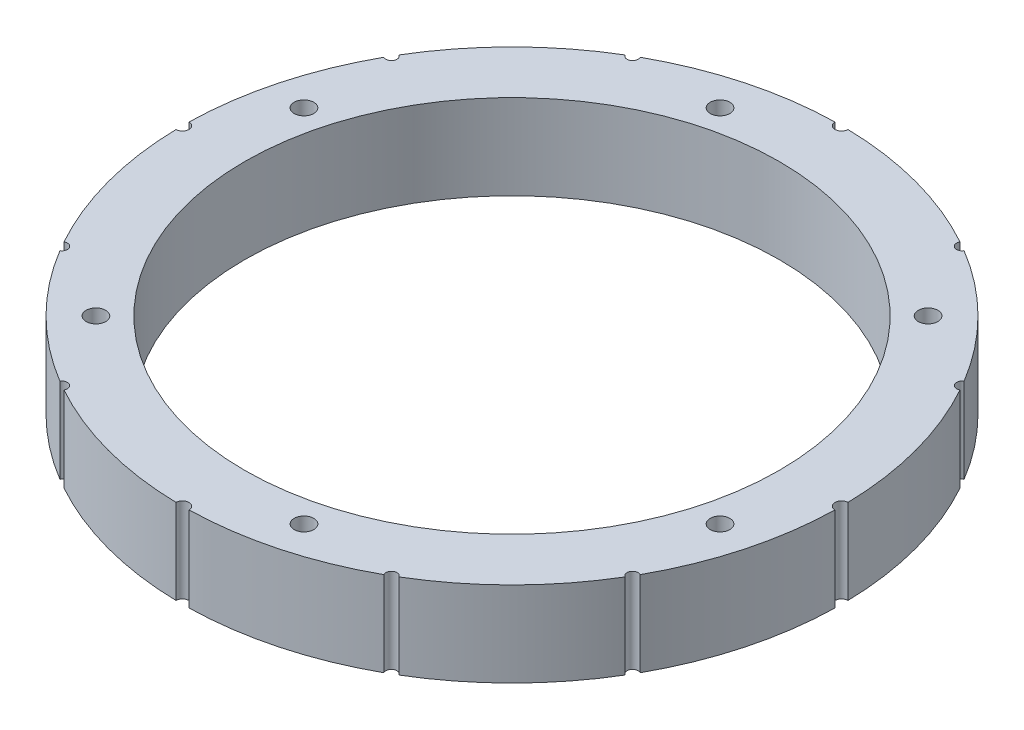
ISO-10303-21;
HEADER;
FILE_DESCRIPTION(('STEP AP214'),'2;1');
FILE_NAME('part.step','',(''),(''),'','','');
FILE_SCHEMA(('AUTOMOTIVE_DESIGN { 1 0 10303 214 1 1 1 1 }'));
ENDSEC;
DATA;
#1=APPLICATION_CONTEXT('core data for automotive mechanical design processes');
#2=APPLICATION_PROTOCOL_DEFINITION('international standard','automotive_design',2000,#1);
#3=PRODUCT_CONTEXT('',#1,'mechanical');
#4=PRODUCT('Part','Part','',(#3));
#5=PRODUCT_RELATED_PRODUCT_CATEGORY('part','',(#4));
#6=PRODUCT_DEFINITION_FORMATION('','',#4);
#7=PRODUCT_DEFINITION_CONTEXT('part definition',#1,'design');
#8=PRODUCT_DEFINITION('design','',#6,#7);
#9=PRODUCT_DEFINITION_SHAPE('','',#8);
#10=(LENGTH_UNIT() NAMED_UNIT(*) SI_UNIT(.MILLI.,.METRE.));
#11=(NAMED_UNIT(*) PLANE_ANGLE_UNIT() SI_UNIT($,.RADIAN.));
#12=(NAMED_UNIT(*) SI_UNIT($,.STERADIAN.) SOLID_ANGLE_UNIT());
#13=UNCERTAINTY_MEASURE_WITH_UNIT(LENGTH_MEASURE(1.E-05),#10,'distance_accuracy_value','');
#14=(GEOMETRIC_REPRESENTATION_CONTEXT(3) GLOBAL_UNCERTAINTY_ASSIGNED_CONTEXT((#13)) GLOBAL_UNIT_ASSIGNED_CONTEXT((#10,
#11,#12)) REPRESENTATION_CONTEXT('',''));
#15=CARTESIAN_POINT('',(0.,0.,0.));
#16=DIRECTION('',(0.,0.,1.));
#17=DIRECTION('',(1.,0.,0.));
#18=AXIS2_PLACEMENT_3D('',#15,#16,#17);
#19=CARTESIAN_POINT('',(0.,-13.,0.));
#20=DIRECTION('',(0.,1.,0.));
#21=DIRECTION('',(0.,0.,1.));
#22=AXIS2_PLACEMENT_3D('',#19,#20,#21);
#23=CYLINDRICAL_SURFACE('',#22,50.4);
#24=DIRECTION('',(0.,-1.,0.));
#25=VECTOR('',#24,1.);
#26=CARTESIAN_POINT('',(0.999950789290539,-6.5,50.3900793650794));
#27=LINE('',#26,#25);
#28=CARTESIAN_POINT('',(0.999950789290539,-13.,50.3900793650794));
#29=VERTEX_POINT('',#28);
#30=CARTESIAN_POINT('',(0.999950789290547,0.,50.3900793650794));
#31=VERTEX_POINT('',#30);
#32=EDGE_CURVE('E289',#29,#31,#27,.F.);
#33=ORIENTED_EDGE('',*,*,#32,.F.);
#34=CARTESIAN_POINT('',(0.,-13.,0.));
#35=DIRECTION('',(0.,1.,0.));
#36=DIRECTION('',(0.,0.,1.));
#37=AXIS2_PLACEMENT_3D('',#34,#35,#36);
#38=CIRCLE('',#37,50.4);
#39=CARTESIAN_POINT('',(24.4603207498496,-13.,44.0664578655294));
#40=VERTEX_POINT('',#39);
#41=EDGE_CURVE('E240',#29,#40,#38,.T.);
#42=ORIENTED_EDGE('',*,*,#41,.T.);
#43=DIRECTION('',(0.,-1.,0.));
#44=VECTOR('',#43,1.);
#45=CARTESIAN_POINT('',(24.4603207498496,-6.5,44.0664578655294));
#46=LINE('',#45,#44);
#47=CARTESIAN_POINT('',(24.4603207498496,0.,44.0664578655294));
#48=VERTEX_POINT('',#47);
#49=EDGE_CURVE('E318',#48,#40,#46,.T.);
#50=ORIENTED_EDGE('',*,*,#49,.F.);
#51=CARTESIAN_POINT('',(0.,0.,0.));
#52=DIRECTION('',(0.,1.,0.));
#53=DIRECTION('',(0.,0.,1.));
#54=AXIS2_PLACEMENT_3D('',#51,#52,#53);
#55=CIRCLE('',#54,50.4);
#56=EDGE_CURVE('E233',#31,#48,#55,.T.);
#57=ORIENTED_EDGE('',*,*,#56,.F.);
#58=EDGE_LOOP('',(#33,#42,#50,#57));
#59=FACE_BOUND('',#58,.T.);
#60=ADVANCED_FACE('F39',(#59),#23,.T.);
#61=DIRECTION('',(0.,-1.,0.));
#62=VECTOR('',#61,1.);
#63=CARTESIAN_POINT('',(-43.2164880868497,-6.5,25.9325115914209));
#64=LINE('',#63,#62);
#65=CARTESIAN_POINT('',(-43.2164880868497,-13.,25.9325115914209));
#66=VERTEX_POINT('',#65);
#67=CARTESIAN_POINT('',(-43.2164880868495,0.,25.9325115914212));
#68=VERTEX_POINT('',#67);
#69=EDGE_CURVE('E62',#66,#68,#64,.F.);
#70=ORIENTED_EDGE('',*,*,#69,.F.);
#71=CARTESIAN_POINT('',(-25.9325115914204,-13.,43.21648808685));
#72=VERTEX_POINT('',#71);
#73=EDGE_CURVE('E479',#66,#72,#38,.T.);
#74=ORIENTED_EDGE('',*,*,#73,.T.);
#75=DIRECTION('',(0.,-1.,0.));
#76=VECTOR('',#75,1.);
#77=CARTESIAN_POINT('',(-25.9325115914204,-6.5,43.21648808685));
#78=LINE('',#77,#76);
#79=CARTESIAN_POINT('',(-25.9325115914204,0.,43.21648808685));
#80=VERTEX_POINT('',#79);
#81=EDGE_CURVE('E314',#80,#72,#78,.T.);
#82=ORIENTED_EDGE('',*,*,#81,.F.);
#83=EDGE_CURVE('E276',#68,#80,#55,.T.);
#84=ORIENTED_EDGE('',*,*,#83,.F.);
#85=EDGE_LOOP('',(#70,#74,#82,#84));
#86=FACE_BOUND('',#85,.T.);
#87=ADVANCED_FACE('F441',(#86),#23,.T.);
#88=DIRECTION('',(0.,-1.,0.));
#89=VECTOR('',#88,1.);
#90=CARTESIAN_POINT('',(-44.0664578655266,-6.5,-24.4603207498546));
#91=LINE('',#90,#89);
#92=CARTESIAN_POINT('',(-44.0664578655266,-13.,-24.4603207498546));
#93=VERTEX_POINT('',#92);
#94=CARTESIAN_POINT('',(-44.0664578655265,0.,-24.4603207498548));
#95=VERTEX_POINT('',#94);
#96=EDGE_CURVE('E297',#93,#95,#91,.F.);
#97=ORIENTED_EDGE('',*,*,#96,.F.);
#98=CARTESIAN_POINT('',(-50.3900793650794,-13.,-0.999950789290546));
#99=VERTEX_POINT('',#98);
#100=EDGE_CURVE('E469',#93,#99,#38,.T.);
#101=ORIENTED_EDGE('',*,*,#100,.T.);
#102=DIRECTION('',(0.,-1.,0.));
#103=VECTOR('',#102,1.);
#104=CARTESIAN_POINT('',(-50.3900793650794,-6.5,-0.999950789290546));
#105=LINE('',#104,#103);
#106=CARTESIAN_POINT('',(-50.3900793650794,0.,-0.999950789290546));
#107=VERTEX_POINT('',#106);
#108=EDGE_CURVE('E311',#107,#99,#105,.T.);
#109=ORIENTED_EDGE('',*,*,#108,.F.);
#110=EDGE_CURVE('E269',#95,#107,#55,.T.);
#111=ORIENTED_EDGE('',*,*,#110,.F.);
#112=EDGE_LOOP('',(#97,#101,#109,#111));
#113=FACE_BOUND('',#112,.T.);
#114=ADVANCED_FACE('F446',(#113),#23,.T.);
#115=DIRECTION('',(0.,-1.,0.));
#116=VECTOR('',#115,1.);
#117=CARTESIAN_POINT('',(-43.216488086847,-6.5,-25.9325115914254));
#118=LINE('',#117,#116);
#119=CARTESIAN_POINT('',(-43.216488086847,0.,-25.9325115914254));
#120=VERTEX_POINT('',#119);
#121=CARTESIAN_POINT('',(-43.216488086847,-13.,-25.9325115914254));
#122=VERTEX_POINT('',#121);
#123=EDGE_CURVE('E299',#120,#122,#118,.T.);
#124=ORIENTED_EDGE('',*,*,#123,.F.);
#125=CARTESIAN_POINT('',(-25.9325115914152,0.,-43.2164880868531));
#126=VERTEX_POINT('',#125);
#127=EDGE_CURVE('E268',#126,#120,#55,.T.);
#128=ORIENTED_EDGE('',*,*,#127,.F.);
#129=DIRECTION('',(0.,-1.,0.));
#130=VECTOR('',#129,1.);
#131=CARTESIAN_POINT('',(-25.9325115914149,-6.5,-43.2164880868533));
#132=LINE('',#131,#130);
#133=CARTESIAN_POINT('',(-25.9325115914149,-13.,-43.2164880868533));
#134=VERTEX_POINT('',#133);
#135=EDGE_CURVE('E253',#134,#126,#132,.F.);
#136=ORIENTED_EDGE('',*,*,#135,.F.);
#137=EDGE_CURVE('E467',#134,#122,#38,.T.);
#138=ORIENTED_EDGE('',*,*,#137,.T.);
#139=EDGE_LOOP('',(#124,#128,#136,#138));
#140=FACE_BOUND('',#139,.T.);
#141=ADVANCED_FACE('F812',(#140),#23,.T.);
#142=DIRECTION('',(0.,-1.,0.));
#143=VECTOR('',#142,1.);
#144=CARTESIAN_POINT('',(50.3900793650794,-6.5,-0.999950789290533));
#145=LINE('',#144,#143);
#146=CARTESIAN_POINT('',(50.3900793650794,-13.,-0.999950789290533));
#147=VERTEX_POINT('',#146);
#148=CARTESIAN_POINT('',(50.3900793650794,0.,-0.999950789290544));
#149=VERTEX_POINT('',#148);
#150=EDGE_CURVE('E264',#147,#149,#145,.F.);
#151=ORIENTED_EDGE('',*,*,#150,.F.);
#152=CARTESIAN_POINT('',(44.0664578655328,-13.,-24.4603207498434));
#153=VERTEX_POINT('',#152);
#154=EDGE_CURVE('E501',#147,#153,#38,.T.);
#155=ORIENTED_EDGE('',*,*,#154,.T.);
#156=DIRECTION('',(0.,-1.,0.));
#157=VECTOR('',#156,1.);
#158=CARTESIAN_POINT('',(44.0664578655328,-6.5,-24.4603207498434));
#159=LINE('',#158,#157);
#160=CARTESIAN_POINT('',(44.0664578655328,0.,-24.4603207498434));
#161=VERTEX_POINT('',#160);
#162=EDGE_CURVE('E326',#161,#153,#159,.T.);
#163=ORIENTED_EDGE('',*,*,#162,.F.);
#164=EDGE_CURVE('E228',#149,#161,#55,.T.);
#165=ORIENTED_EDGE('',*,*,#164,.F.);
#166=EDGE_LOOP('',(#151,#155,#163,#165));
#167=FACE_BOUND('',#166,.T.);
#168=ADVANCED_FACE('F511',(#167),#23,.T.);
#169=DIRECTION('',(0.,-1.,0.));
#170=VECTOR('',#169,1.);
#171=CARTESIAN_POINT('',(-24.4603207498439,-6.5,-44.0664578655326));
#172=LINE('',#171,#170);
#173=CARTESIAN_POINT('',(-24.4603207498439,0.,-44.0664578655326));
#174=VERTEX_POINT('',#173);
#175=CARTESIAN_POINT('',(-24.4603207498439,-13.,-44.0664578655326));
#176=VERTEX_POINT('',#175);
#177=EDGE_CURVE('E250',#174,#176,#172,.T.);
#178=ORIENTED_EDGE('',*,*,#177,.F.);
#179=CARTESIAN_POINT('',(-0.999950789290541,0.,-50.3900793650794));
#180=VERTEX_POINT('',#179);
#181=EDGE_CURVE('E232',#180,#174,#55,.T.);
#182=ORIENTED_EDGE('',*,*,#181,.F.);
#183=DIRECTION('',(0.,-1.,0.));
#184=VECTOR('',#183,1.);
#185=CARTESIAN_POINT('',(-0.999950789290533,-6.5,-50.3900793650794));
#186=LINE('',#185,#184);
#187=CARTESIAN_POINT('',(-0.999950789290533,-13.,-50.3900793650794));
#188=VERTEX_POINT('',#187);
#189=EDGE_CURVE('E305',#188,#180,#186,.F.);
#190=ORIENTED_EDGE('',*,*,#189,.F.);
#191=EDGE_CURVE('E263',#188,#176,#38,.T.);
#192=ORIENTED_EDGE('',*,*,#191,.T.);
#193=EDGE_LOOP('',(#178,#182,#190,#192));
#194=FACE_BOUND('',#193,.T.);
#195=ADVANCED_FACE('F260',(#194),#23,.T.);
#196=DIRECTION('',(0.,-1.,0.));
#197=VECTOR('',#196,1.);
#198=CARTESIAN_POINT('',(-44.0664578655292,-6.5,24.46032074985));
#199=LINE('',#198,#197);
#200=CARTESIAN_POINT('',(-44.0664578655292,0.,24.46032074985));
#201=VERTEX_POINT('',#200);
#202=CARTESIAN_POINT('',(-44.0664578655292,-13.,24.46032074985));
#203=VERTEX_POINT('',#202);
#204=EDGE_CURVE('E295',#201,#203,#199,.T.);
#205=ORIENTED_EDGE('',*,*,#204,.F.);
#206=CARTESIAN_POINT('',(-50.3900793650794,0.,0.999950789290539));
#207=VERTEX_POINT('',#206);
#208=EDGE_CURVE('E272',#207,#201,#55,.T.);
#209=ORIENTED_EDGE('',*,*,#208,.F.);
#210=DIRECTION('',(0.,-1.,0.));
#211=VECTOR('',#210,1.);
#212=CARTESIAN_POINT('',(-50.3900793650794,-6.5,0.999950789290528));
#213=LINE('',#212,#211);
#214=CARTESIAN_POINT('',(-50.3900793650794,-13.,0.999950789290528));
#215=VERTEX_POINT('',#214);
#216=EDGE_CURVE('E309',#215,#207,#213,.F.);
#217=ORIENTED_EDGE('',*,*,#216,.F.);
#218=EDGE_CURVE('E473',#215,#203,#38,.T.);
#219=ORIENTED_EDGE('',*,*,#218,.T.);
#220=EDGE_LOOP('',(#205,#209,#217,#219));
#221=FACE_BOUND('',#220,.T.);
#222=ADVANCED_FACE('F793',(#221),#23,.T.);
#223=DIRECTION('',(0.,-1.,0.));
#224=VECTOR('',#223,1.);
#225=CARTESIAN_POINT('',(-0.999950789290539,-6.5,50.3900793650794));
#226=LINE('',#225,#224);
#227=CARTESIAN_POINT('',(-0.999950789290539,0.,50.3900793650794));
#228=VERTEX_POINT('',#227);
#229=CARTESIAN_POINT('',(-0.999950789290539,-13.,50.3900793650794));
#230=VERTEX_POINT('',#229);
#231=EDGE_CURVE('E292',#228,#230,#226,.T.);
#232=ORIENTED_EDGE('',*,*,#231,.F.);
#233=CARTESIAN_POINT('',(-24.4603207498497,0.,44.0664578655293));
#234=VERTEX_POINT('',#233);
#235=EDGE_CURVE('E239',#234,#228,#55,.T.);
#236=ORIENTED_EDGE('',*,*,#235,.F.);
#237=DIRECTION('',(0.,-1.,0.));
#238=VECTOR('',#237,1.);
#239=CARTESIAN_POINT('',(-24.4603207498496,-6.5,44.0664578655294));
#240=LINE('',#239,#238);
#241=CARTESIAN_POINT('',(-24.4603207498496,-13.,44.0664578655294));
#242=VERTEX_POINT('',#241);
#243=EDGE_CURVE('E54',#242,#234,#240,.F.);
#244=ORIENTED_EDGE('',*,*,#243,.F.);
#245=EDGE_CURVE('E237',#242,#230,#38,.T.);
#246=ORIENTED_EDGE('',*,*,#245,.T.);
#247=EDGE_LOOP('',(#232,#236,#244,#246));
#248=FACE_BOUND('',#247,.T.);
#249=ADVANCED_FACE('F786',(#248),#23,.T.);
#250=DIRECTION('',(0.,-1.,0.));
#251=VECTOR('',#250,1.);
#252=CARTESIAN_POINT('',(25.9325115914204,-6.5,43.21648808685));
#253=LINE('',#252,#251);
#254=CARTESIAN_POINT('',(25.9325115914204,-13.,43.21648808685));
#255=VERTEX_POINT('',#254);
#256=CARTESIAN_POINT('',(25.9325115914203,0.,43.2164880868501));
#257=VERTEX_POINT('',#256);
#258=EDGE_CURVE('E316',#255,#257,#253,.F.);
#259=ORIENTED_EDGE('',*,*,#258,.F.);
#260=CARTESIAN_POINT('',(43.216488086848,-13.,25.9325115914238));
#261=VERTEX_POINT('',#260);
#262=EDGE_CURVE('E492',#255,#261,#38,.T.);
#263=ORIENTED_EDGE('',*,*,#262,.T.);
#264=DIRECTION('',(0.,-1.,0.));
#265=VECTOR('',#264,1.);
#266=CARTESIAN_POINT('',(43.216488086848,-6.5,25.9325115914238));
#267=LINE('',#266,#265);
#268=CARTESIAN_POINT('',(43.216488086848,0.,25.9325115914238));
#269=VERTEX_POINT('',#268);
#270=EDGE_CURVE('E322',#269,#261,#267,.T.);
#271=ORIENTED_EDGE('',*,*,#270,.F.);
#272=EDGE_CURVE('E238',#257,#269,#55,.T.);
#273=ORIENTED_EDGE('',*,*,#272,.F.);
#274=EDGE_LOOP('',(#259,#263,#271,#273));
#275=FACE_BOUND('',#274,.T.);
#276=ADVANCED_FACE('F779',(#275),#23,.T.);
#277=DIRECTION('',(0.,-1.,0.));
#278=VECTOR('',#277,1.);
#279=CARTESIAN_POINT('',(50.3900793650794,-6.5,0.99995078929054));
#280=LINE('',#279,#278);
#281=CARTESIAN_POINT('',(50.3900793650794,0.,0.99995078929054));
#282=VERTEX_POINT('',#281);
#283=CARTESIAN_POINT('',(50.3900793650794,-13.,0.99995078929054));
#284=VERTEX_POINT('',#283);
#285=EDGE_CURVE('E303',#282,#284,#280,.T.);
#286=ORIENTED_EDGE('',*,*,#285,.F.);
#287=CARTESIAN_POINT('',(44.0664578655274,0.,24.4603207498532));
#288=VERTEX_POINT('',#287);
#289=EDGE_CURVE('E231',#288,#282,#55,.T.);
#290=ORIENTED_EDGE('',*,*,#289,.F.);
#291=DIRECTION('',(0.,-1.,0.));
#292=VECTOR('',#291,1.);
#293=CARTESIAN_POINT('',(44.0664578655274,-6.5,24.4603207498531));
#294=LINE('',#293,#292);
#295=CARTESIAN_POINT('',(44.0664578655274,-13.,24.4603207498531));
#296=VERTEX_POINT('',#295);
#297=EDGE_CURVE('E320',#296,#288,#294,.F.);
#298=ORIENTED_EDGE('',*,*,#297,.F.);
#299=EDGE_CURVE('E495',#296,#284,#38,.T.);
#300=ORIENTED_EDGE('',*,*,#299,.T.);
#301=EDGE_LOOP('',(#286,#290,#298,#300));
#302=FACE_BOUND('',#301,.T.);
#303=ADVANCED_FACE('F456',(#302),#23,.T.);
#304=DIRECTION('',(0.,-1.,0.));
#305=VECTOR('',#304,1.);
#306=CARTESIAN_POINT('',(43.2164880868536,-6.5,-25.9325115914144));
#307=LINE('',#306,#305);
#308=CARTESIAN_POINT('',(43.2164880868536,-13.,-25.9325115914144));
#309=VERTEX_POINT('',#308);
#310=CARTESIAN_POINT('',(43.2164880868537,0.,-25.9325115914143));
#311=VERTEX_POINT('',#310);
#312=EDGE_CURVE('E324',#309,#311,#307,.F.);
#313=ORIENTED_EDGE('',*,*,#312,.F.);
#314=CARTESIAN_POINT('',(25.9325115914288,-13.,-43.216488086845));
#315=VERTEX_POINT('',#314);
#316=EDGE_CURVE('E219',#309,#315,#38,.T.);
#317=ORIENTED_EDGE('',*,*,#316,.T.);
#318=DIRECTION('',(0.,-1.,0.));
#319=VECTOR('',#318,1.);
#320=CARTESIAN_POINT('',(25.9325115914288,-6.5,-43.216488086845));
#321=LINE('',#320,#319);
#322=CARTESIAN_POINT('',(25.9325115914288,0.,-43.216488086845));
#323=VERTEX_POINT('',#322);
#324=EDGE_CURVE('E201',#323,#315,#321,.T.);
#325=ORIENTED_EDGE('',*,*,#324,.F.);
#326=EDGE_CURVE('E217',#311,#323,#55,.T.);
#327=ORIENTED_EDGE('',*,*,#326,.F.);
#328=EDGE_LOOP('',(#313,#317,#325,#327));
#329=FACE_BOUND('',#328,.T.);
#330=ADVANCED_FACE('F216',(#329),#23,.T.);
#331=DIRECTION('',(0.,-1.,0.));
#332=VECTOR('',#331,1.);
#333=CARTESIAN_POINT('',(0.999950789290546,-6.5,-50.3900793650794));
#334=LINE('',#333,#332);
#335=CARTESIAN_POINT('',(0.999950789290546,0.,-50.3900793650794));
#336=VERTEX_POINT('',#335);
#337=CARTESIAN_POINT('',(0.999950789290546,-13.,-50.3900793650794));
#338=VERTEX_POINT('',#337);
#339=EDGE_CURVE('E307',#336,#338,#334,.T.);
#340=ORIENTED_EDGE('',*,*,#339,.F.);
#341=CARTESIAN_POINT('',(24.4603207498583,0.,-44.0664578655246));
#342=VERTEX_POINT('',#341);
#343=EDGE_CURVE('E229',#342,#336,#55,.T.);
#344=ORIENTED_EDGE('',*,*,#343,.F.);
#345=DIRECTION('',(0.,-1.,0.));
#346=VECTOR('',#345,1.);
#347=CARTESIAN_POINT('',(24.4603207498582,-6.5,-44.0664578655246));
#348=LINE('',#347,#346);
#349=CARTESIAN_POINT('',(24.4603207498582,-13.,-44.0664578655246));
#350=VERTEX_POINT('',#349);
#351=EDGE_CURVE('E204',#350,#342,#348,.F.);
#352=ORIENTED_EDGE('',*,*,#351,.F.);
#353=EDGE_CURVE('E460',#350,#338,#38,.T.);
#354=ORIENTED_EDGE('',*,*,#353,.T.);
#355=EDGE_LOOP('',(#340,#344,#352,#354));
#356=FACE_BOUND('',#355,.T.);
#357=ADVANCED_FACE('F41',(#356),#23,.T.);
#358=CARTESIAN_POINT('',(0.,-13.,0.));
#359=DIRECTION('',(0.,1.,0.));
#360=DIRECTION('',(0.,0.,1.));
#361=AXIS2_PLACEMENT_3D('',#358,#359,#360);
#362=PLANE('',#361);
#363=CARTESIAN_POINT('',(0.,-13.,0.));
#364=DIRECTION('',(0.,1.,0.));
#365=DIRECTION('',(0.,0.,1.));
#366=AXIS2_PLACEMENT_3D('',#363,#364,#365);
#367=CIRCLE('',#366,40.9);
#368=CARTESIAN_POINT('',(0.,-13.,40.9));
#369=VERTEX_POINT('',#368);
#370=EDGE_CURVE('E281',#369,#369,#367,.T.);
#371=ORIENTED_EDGE('',*,*,#370,.T.);
#372=EDGE_LOOP('',(#371));
#373=FACE_BOUND('',#372,.T.);
#374=ORIENTED_EDGE('',*,*,#41,.F.);
#375=CARTESIAN_POINT('',(0.,-13.,50.4));
#376=DIRECTION('',(0.,-1.,0.));
#377=DIRECTION('',(0.,0.,-1.));
#378=AXIS2_PLACEMENT_3D('',#375,#376,#377);
#379=CIRCLE('',#378,1.);
#380=EDGE_CURVE('E220',#230,#29,#379,.T.);
#381=ORIENTED_EDGE('',*,*,#380,.F.);
#382=ORIENTED_EDGE('',*,*,#245,.F.);
#383=CARTESIAN_POINT('',(-25.2000000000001,-13.,43.6476803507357));
#384=DIRECTION('',(0.,-1.,0.));
#385=DIRECTION('',(0.,0.,-1.));
#386=AXIS2_PLACEMENT_3D('',#383,#384,#385);
#387=CIRCLE('',#386,0.850000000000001);
#388=EDGE_CURVE('E329',#72,#242,#387,.T.);
#389=ORIENTED_EDGE('',*,*,#388,.F.);
#390=ORIENTED_EDGE('',*,*,#73,.F.);
#391=CARTESIAN_POINT('',(-43.6476803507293,-13.,25.199999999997));
#392=DIRECTION('',(0.,-1.,0.));
#393=DIRECTION('',(0.,0.,1.));
#394=AXIS2_PLACEMENT_3D('',#391,#392,#393);
#395=CIRCLE('',#394,0.85);
#396=EDGE_CURVE('E353',#203,#66,#395,.T.);
#397=ORIENTED_EDGE('',*,*,#396,.F.);
#398=ORIENTED_EDGE('',*,*,#218,.F.);
#399=CARTESIAN_POINT('',(-50.4,-13.,0.));
#400=DIRECTION('',(0.,-1.,0.));
#401=DIRECTION('',(0.,0.,-1.));
#402=AXIS2_PLACEMENT_3D('',#399,#400,#401);
#403=CIRCLE('',#402,0.999999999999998);
#404=EDGE_CURVE('E331',#99,#215,#403,.T.);
#405=ORIENTED_EDGE('',*,*,#404,.F.);
#406=ORIENTED_EDGE('',*,*,#100,.F.);
#407=CARTESIAN_POINT('',(-43.6476803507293,-13.,-25.2000000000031));
#408=DIRECTION('',(0.,-1.,0.));
#409=DIRECTION('',(0.,0.,-1.));
#410=AXIS2_PLACEMENT_3D('',#407,#408,#409);
#411=CIRCLE('',#410,0.850000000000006);
#412=EDGE_CURVE('E358',#122,#93,#411,.T.);
#413=ORIENTED_EDGE('',*,*,#412,.F.);
#414=ORIENTED_EDGE('',*,*,#137,.F.);
#415=CARTESIAN_POINT('',(-25.1999999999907,-13.,-43.6476803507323));
#416=DIRECTION('',(0.,-1.,0.));
#417=DIRECTION('',(0.,0.,1.));
#418=AXIS2_PLACEMENT_3D('',#415,#416,#417);
#419=CIRCLE('',#418,0.849999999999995);
#420=EDGE_CURVE('E344',#176,#134,#419,.T.);
#421=ORIENTED_EDGE('',*,*,#420,.F.);
#422=ORIENTED_EDGE('',*,*,#191,.F.);
#423=CARTESIAN_POINT('',(0.,-13.,-50.4));
#424=DIRECTION('',(0.,-1.,0.));
#425=DIRECTION('',(0.,0.,-1.));
#426=AXIS2_PLACEMENT_3D('',#423,#424,#425);
#427=CIRCLE('',#426,1.);
#428=EDGE_CURVE('E336',#338,#188,#427,.T.);
#429=ORIENTED_EDGE('',*,*,#428,.F.);
#430=ORIENTED_EDGE('',*,*,#353,.F.);
#431=CARTESIAN_POINT('',(25.2000000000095,-13.,-43.6476803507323));
#432=DIRECTION('',(0.,-1.,0.));
#433=DIRECTION('',(0.,0.,-1.));
#434=AXIS2_PLACEMENT_3D('',#431,#432,#433);
#435=CIRCLE('',#434,0.850000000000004);
#436=EDGE_CURVE('E210',#315,#350,#435,.T.);
#437=ORIENTED_EDGE('',*,*,#436,.F.);
#438=ORIENTED_EDGE('',*,*,#316,.F.);
#439=CARTESIAN_POINT('',(43.6476803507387,-13.,-25.1999999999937));
#440=DIRECTION('',(0.,-1.,0.));
#441=DIRECTION('',(0.,0.,1.));
#442=AXIS2_PLACEMENT_3D('',#439,#440,#441);
#443=CIRCLE('',#442,0.850000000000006);
#444=EDGE_CURVE('E209',#153,#309,#443,.T.);
#445=ORIENTED_EDGE('',*,*,#444,.F.);
#446=ORIENTED_EDGE('',*,*,#154,.F.);
#447=CARTESIAN_POINT('',(50.4,-13.,0.));
#448=DIRECTION('',(0.,-1.,0.));
#449=DIRECTION('',(0.,0.,-1.));
#450=AXIS2_PLACEMENT_3D('',#447,#448,#449);
#451=CIRCLE('',#450,0.999999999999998);
#452=EDGE_CURVE('E339',#284,#147,#451,.T.);
#453=ORIENTED_EDGE('',*,*,#452,.F.);
#454=ORIENTED_EDGE('',*,*,#299,.F.);
#455=CARTESIAN_POINT('',(43.6476803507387,-13.,25.2000000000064));
#456=DIRECTION('',(0.,-1.,0.));
#457=DIRECTION('',(0.,0.,-1.));
#458=AXIS2_PLACEMENT_3D('',#455,#456,#457);
#459=CIRCLE('',#458,0.850000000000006);
#460=EDGE_CURVE('E347',#261,#296,#459,.T.);
#461=ORIENTED_EDGE('',*,*,#460,.F.);
#462=ORIENTED_EDGE('',*,*,#262,.F.);
#463=CARTESIAN_POINT('',(25.2000000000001,-13.,43.6476803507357));
#464=DIRECTION('',(0.,-1.,0.));
#465=DIRECTION('',(0.,0.,1.));
#466=AXIS2_PLACEMENT_3D('',#463,#464,#465);
#467=CIRCLE('',#466,0.850000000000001);
#468=EDGE_CURVE('E349',#40,#255,#467,.T.);
#469=ORIENTED_EDGE('',*,*,#468,.F.);
#470=EDGE_LOOP('',(#374,#381,#382,#389,#390,#397,#398,#405,#406,#413,#414,#421,#422,#429,#430,
#437,#438,#445,#446,#453,#454,#461,#462,#469));
#471=FACE_BOUND('',#470,.T.);
#472=ADVANCED_FACE('F412',(#373,#471),#362,.F.);
#473=CARTESIAN_POINT('',(0.,0.,0.));
#474=DIRECTION('',(0.,1.,0.));
#475=DIRECTION('',(0.,0.,1.));
#476=AXIS2_PLACEMENT_3D('',#473,#474,#475);
#477=PLANE('',#476);
#478=CARTESIAN_POINT('',(31.8198051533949,0.,-31.8198051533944));
#479=DIRECTION('',(0.,1.,0.));
#480=DIRECTION('',(-0.86602540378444,0.,0.499999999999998));
#481=AXIS2_PLACEMENT_3D('',#478,#479,#480);
#482=CIRCLE('',#481,1.5);
#483=CARTESIAN_POINT('',(30.5207670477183,0.,-31.0698051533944));
#484=VERTEX_POINT('',#483);
#485=EDGE_CURVE('E394',#484,#484,#482,.T.);
#486=ORIENTED_EDGE('',*,*,#485,.F.);
#487=EDGE_LOOP('',(#486));
#488=FACE_BOUND('',#487,.T.);
#489=CARTESIAN_POINT('',(43.466662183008,0.,11.6468570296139));
#490=DIRECTION('',(0.,1.,0.));
#491=DIRECTION('',(-0.866025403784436,0.,-0.500000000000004));
#492=AXIS2_PLACEMENT_3D('',#489,#490,#491);
#493=CIRCLE('',#492,1.5);
#494=CARTESIAN_POINT('',(42.1676240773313,0.,10.8968570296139));
#495=VERTEX_POINT('',#494);
#496=EDGE_CURVE('E388',#495,#495,#493,.T.);
#497=ORIENTED_EDGE('',*,*,#496,.F.);
#498=EDGE_LOOP('',(#497));
#499=FACE_BOUND('',#498,.T.);
#500=CARTESIAN_POINT('',(11.6468570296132,0.,43.4666621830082));
#501=DIRECTION('',(0.,1.,0.));
#502=DIRECTION('',(0.,0.,-1.));
#503=AXIS2_PLACEMENT_3D('',#500,#501,#502);
#504=CIRCLE('',#503,1.5);
#505=CARTESIAN_POINT('',(11.6468570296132,0.,41.9666621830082));
#506=VERTEX_POINT('',#505);
#507=EDGE_CURVE('E382',#506,#506,#504,.T.);
#508=ORIENTED_EDGE('',*,*,#507,.F.);
#509=EDGE_LOOP('',(#508));
#510=FACE_BOUND('',#509,.T.);
#511=CARTESIAN_POINT('',(-31.8198051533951,0.,31.8198051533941));
#512=DIRECTION('',(0.,1.,0.));
#513=DIRECTION('',(0.866025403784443,0.,-0.499999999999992));
#514=AXIS2_PLACEMENT_3D('',#511,#512,#513);
#515=CIRCLE('',#514,1.5);
#516=CARTESIAN_POINT('',(-30.5207670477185,0.,31.0698051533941));
#517=VERTEX_POINT('',#516);
#518=EDGE_CURVE('E376',#517,#517,#515,.T.);
#519=ORIENTED_EDGE('',*,*,#518,.F.);
#520=EDGE_LOOP('',(#519));
#521=FACE_BOUND('',#520,.T.);
#522=CARTESIAN_POINT('',(-43.4666621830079,0.,-11.6468570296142));
#523=DIRECTION('',(0.,1.,0.));
#524=DIRECTION('',(0.866025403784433,0.,0.50000000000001));
#525=AXIS2_PLACEMENT_3D('',#522,#523,#524);
#526=CIRCLE('',#525,1.5);
#527=CARTESIAN_POINT('',(-42.1676240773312,0.,-10.8968570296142));
#528=VERTEX_POINT('',#527);
#529=EDGE_CURVE('E370',#528,#528,#526,.T.);
#530=ORIENTED_EDGE('',*,*,#529,.F.);
#531=EDGE_LOOP('',(#530));
#532=FACE_BOUND('',#531,.T.);
#533=CARTESIAN_POINT('',(-11.6468570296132,0.,-43.4666621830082));
#534=DIRECTION('',(0.,1.,0.));
#535=DIRECTION('',(0.,0.,1.));
#536=AXIS2_PLACEMENT_3D('',#533,#534,#535);
#537=CIRCLE('',#536,1.5);
#538=CARTESIAN_POINT('',(-11.6468570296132,0.,-41.9666621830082));
#539=VERTEX_POINT('',#538);
#540=EDGE_CURVE('E364',#539,#539,#537,.T.);
#541=ORIENTED_EDGE('',*,*,#540,.F.);
#542=EDGE_LOOP('',(#541));
#543=FACE_BOUND('',#542,.T.);
#544=CARTESIAN_POINT('',(0.,0.,50.4));
#545=DIRECTION('',(0.,1.,0.));
#546=DIRECTION('',(0.,0.,1.));
#547=AXIS2_PLACEMENT_3D('',#544,#545,#546);
#548=CIRCLE('',#547,1.);
#549=EDGE_CURVE('E11',#31,#228,#548,.T.);
#550=ORIENTED_EDGE('',*,*,#549,.F.);
#551=ORIENTED_EDGE('',*,*,#56,.T.);
#552=CARTESIAN_POINT('',(25.2000000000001,0.,43.6476803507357));
#553=DIRECTION('',(0.,-1.,0.));
#554=DIRECTION('',(0.,0.,1.));
#555=AXIS2_PLACEMENT_3D('',#552,#553,#554);
#556=CIRCLE('',#555,0.850000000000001);
#557=EDGE_CURVE('E332',#48,#257,#556,.T.);
#558=ORIENTED_EDGE('',*,*,#557,.T.);
#559=ORIENTED_EDGE('',*,*,#272,.T.);
#560=CARTESIAN_POINT('',(43.6476803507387,0.,25.2000000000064));
#561=DIRECTION('',(0.,1.,0.));
#562=DIRECTION('',(0.,0.,1.));
#563=AXIS2_PLACEMENT_3D('',#560,#561,#562);
#564=CIRCLE('',#563,0.850000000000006);
#565=EDGE_CURVE('E243',#288,#269,#564,.T.);
#566=ORIENTED_EDGE('',*,*,#565,.F.);
#567=ORIENTED_EDGE('',*,*,#289,.T.);
#568=CARTESIAN_POINT('',(50.4,0.,0.));
#569=DIRECTION('',(0.,-1.,0.));
#570=DIRECTION('',(0.,0.,-1.));
#571=AXIS2_PLACEMENT_3D('',#568,#569,#570);
#572=CIRCLE('',#571,0.999999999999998);
#573=EDGE_CURVE('E341',#282,#149,#572,.T.);
#574=ORIENTED_EDGE('',*,*,#573,.T.);
#575=ORIENTED_EDGE('',*,*,#164,.T.);
#576=CARTESIAN_POINT('',(43.6476803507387,0.,-25.1999999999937));
#577=DIRECTION('',(0.,1.,0.));
#578=DIRECTION('',(0.,0.,1.));
#579=AXIS2_PLACEMENT_3D('',#576,#577,#578);
#580=CIRCLE('',#579,0.850000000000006);
#581=EDGE_CURVE('E227',#311,#161,#580,.T.);
#582=ORIENTED_EDGE('',*,*,#581,.F.);
#583=ORIENTED_EDGE('',*,*,#326,.T.);
#584=CARTESIAN_POINT('',(25.2000000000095,0.,-43.6476803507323));
#585=DIRECTION('',(0.,-1.,0.));
#586=DIRECTION('',(0.,0.,-1.));
#587=AXIS2_PLACEMENT_3D('',#584,#585,#586);
#588=CIRCLE('',#587,0.850000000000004);
#589=EDGE_CURVE('E198',#323,#342,#588,.T.);
#590=ORIENTED_EDGE('',*,*,#589,.T.);
#591=ORIENTED_EDGE('',*,*,#343,.T.);
#592=CARTESIAN_POINT('',(0.,0.,-50.4));
#593=DIRECTION('',(0.,-1.,0.));
#594=DIRECTION('',(0.,0.,-1.));
#595=AXIS2_PLACEMENT_3D('',#592,#593,#594);
#596=CIRCLE('',#595,1.);
#597=EDGE_CURVE('E267',#336,#180,#596,.T.);
#598=ORIENTED_EDGE('',*,*,#597,.T.);
#599=ORIENTED_EDGE('',*,*,#181,.T.);
#600=CARTESIAN_POINT('',(-25.1999999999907,0.,-43.6476803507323));
#601=DIRECTION('',(0.,1.,0.));
#602=DIRECTION('',(0.,0.,1.));
#603=AXIS2_PLACEMENT_3D('',#600,#601,#602);
#604=CIRCLE('',#603,0.849999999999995);
#605=EDGE_CURVE('E47',#126,#174,#604,.T.);
#606=ORIENTED_EDGE('',*,*,#605,.F.);
#607=ORIENTED_EDGE('',*,*,#127,.T.);
#608=CARTESIAN_POINT('',(-43.6476803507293,0.,-25.2000000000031));
#609=DIRECTION('',(0.,-1.,0.));
#610=DIRECTION('',(0.,0.,-1.));
#611=AXIS2_PLACEMENT_3D('',#608,#609,#610);
#612=CIRCLE('',#611,0.850000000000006);
#613=EDGE_CURVE('E360',#120,#95,#612,.T.);
#614=ORIENTED_EDGE('',*,*,#613,.T.);
#615=ORIENTED_EDGE('',*,*,#110,.T.);
#616=CARTESIAN_POINT('',(-50.4,0.,0.));
#617=DIRECTION('',(0.,-1.,0.));
#618=DIRECTION('',(0.,0.,-1.));
#619=AXIS2_PLACEMENT_3D('',#616,#617,#618);
#620=CIRCLE('',#619,0.999999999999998);
#621=EDGE_CURVE('E334',#107,#207,#620,.T.);
#622=ORIENTED_EDGE('',*,*,#621,.T.);
#623=ORIENTED_EDGE('',*,*,#208,.T.);
#624=CARTESIAN_POINT('',(-43.6476803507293,0.,25.199999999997));
#625=DIRECTION('',(0.,-1.,0.));
#626=DIRECTION('',(0.,0.,1.));
#627=AXIS2_PLACEMENT_3D('',#624,#625,#626);
#628=CIRCLE('',#627,0.85);
#629=EDGE_CURVE('E355',#201,#68,#628,.T.);
#630=ORIENTED_EDGE('',*,*,#629,.T.);
#631=ORIENTED_EDGE('',*,*,#83,.T.);
#632=CARTESIAN_POINT('',(-25.2000000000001,0.,43.6476803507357));
#633=DIRECTION('',(0.,1.,0.));
#634=DIRECTION('',(0.,0.,1.));
#635=AXIS2_PLACEMENT_3D('',#632,#633,#634);
#636=CIRCLE('',#635,0.850000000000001);
#637=EDGE_CURVE('E245',#234,#80,#636,.T.);
#638=ORIENTED_EDGE('',*,*,#637,.F.);
#639=ORIENTED_EDGE('',*,*,#235,.T.);
#640=EDGE_LOOP('',(#550,#551,#558,#559,#566,#567,#574,#575,#582,#583,#590,#591,#598,#599,#606,
#607,#614,#615,#622,#623,#630,#631,#638,#639));
#641=FACE_BOUND('',#640,.T.);
#642=CARTESIAN_POINT('',(0.,0.,0.));
#643=DIRECTION('',(0.,1.,0.));
#644=DIRECTION('',(0.,0.,1.));
#645=AXIS2_PLACEMENT_3D('',#642,#643,#644);
#646=CIRCLE('',#645,40.9);
#647=CARTESIAN_POINT('',(0.,0.,40.9));
#648=VERTEX_POINT('',#647);
#649=EDGE_CURVE('E284',#648,#648,#646,.T.);
#650=ORIENTED_EDGE('',*,*,#649,.F.);
#651=EDGE_LOOP('',(#650));
#652=FACE_BOUND('',#651,.T.);
#653=ADVANCED_FACE('F224',(#488,#499,#510,#521,#532,#543,#641,#652),#477,.T.);
#654=CARTESIAN_POINT('',(0.,-13.,0.));
#655=DIRECTION('',(0.,1.,0.));
#656=DIRECTION('',(0.,0.,1.));
#657=AXIS2_PLACEMENT_3D('',#654,#655,#656);
#658=CYLINDRICAL_SURFACE('',#657,40.9);
#659=CARTESIAN_POINT('',(0.,-13.,40.9));
#660=CARTESIAN_POINT('',(0.,-12.8645833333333,40.9));
#661=CARTESIAN_POINT('',(0.,-12.7291666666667,40.9));
#662=CARTESIAN_POINT('',(0.,-12.4583333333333,40.9));
#663=CARTESIAN_POINT('',(0.,-12.3229166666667,40.9));
#664=CARTESIAN_POINT('',(0.,-12.0520833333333,40.9));
#665=CARTESIAN_POINT('',(0.,-11.9166666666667,40.9));
#666=CARTESIAN_POINT('',(0.,-11.6458333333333,40.9));
#667=CARTESIAN_POINT('',(0.,-11.5104166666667,40.9));
#668=CARTESIAN_POINT('',(0.,-11.2395833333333,40.9));
#669=CARTESIAN_POINT('',(0.,-11.1041666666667,40.9));
#670=CARTESIAN_POINT('',(0.,-10.8333333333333,40.9));
#671=CARTESIAN_POINT('',(0.,-10.6979166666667,40.9));
#672=CARTESIAN_POINT('',(0.,-10.4270833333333,40.9));
#673=CARTESIAN_POINT('',(0.,-10.2916666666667,40.9));
#674=CARTESIAN_POINT('',(0.,-10.0208333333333,40.9));
#675=CARTESIAN_POINT('',(0.,-9.88541666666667,40.9));
#676=CARTESIAN_POINT('',(0.,-9.61458333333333,40.9));
#677=CARTESIAN_POINT('',(0.,-9.47916666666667,40.9));
#678=CARTESIAN_POINT('',(0.,-9.20833333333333,40.9));
#679=CARTESIAN_POINT('',(0.,-9.07291666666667,40.9));
#680=CARTESIAN_POINT('',(0.,-8.80208333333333,40.9));
#681=CARTESIAN_POINT('',(0.,-8.66666666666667,40.9));
#682=CARTESIAN_POINT('',(0.,-8.39583333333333,40.9));
#683=CARTESIAN_POINT('',(0.,-8.26041666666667,40.9));
#684=CARTESIAN_POINT('',(0.,-7.98958333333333,40.9));
#685=CARTESIAN_POINT('',(0.,-7.85416666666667,40.9));
#686=CARTESIAN_POINT('',(0.,-7.58333333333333,40.9));
#687=CARTESIAN_POINT('',(0.,-7.44791666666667,40.9));
#688=CARTESIAN_POINT('',(0.,-7.17708333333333,40.9));
#689=CARTESIAN_POINT('',(0.,-7.04166666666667,40.9));
#690=CARTESIAN_POINT('',(0.,-6.77083333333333,40.9));
#691=CARTESIAN_POINT('',(0.,-6.63541666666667,40.9));
#692=CARTESIAN_POINT('',(0.,-6.36458333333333,40.9));
#693=CARTESIAN_POINT('',(0.,-6.22916666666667,40.9));
#694=CARTESIAN_POINT('',(0.,-5.95833333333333,40.9));
#695=CARTESIAN_POINT('',(0.,-5.82291666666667,40.9));
#696=CARTESIAN_POINT('',(0.,-5.55208333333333,40.9));
#697=CARTESIAN_POINT('',(0.,-5.41666666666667,40.9));
#698=CARTESIAN_POINT('',(0.,-5.14583333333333,40.9));
#699=CARTESIAN_POINT('',(0.,-5.01041666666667,40.9));
#700=CARTESIAN_POINT('',(0.,-4.73958333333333,40.9));
#701=CARTESIAN_POINT('',(0.,-4.60416666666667,40.9));
#702=CARTESIAN_POINT('',(0.,-4.33333333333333,40.9));
#703=CARTESIAN_POINT('',(0.,-4.19791666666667,40.9));
#704=CARTESIAN_POINT('',(0.,-3.92708333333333,40.9));
#705=CARTESIAN_POINT('',(0.,-3.79166666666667,40.9));
#706=CARTESIAN_POINT('',(0.,-3.52083333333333,40.9));
#707=CARTESIAN_POINT('',(0.,-3.38541666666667,40.9));
#708=CARTESIAN_POINT('',(0.,-3.11458333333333,40.9));
#709=CARTESIAN_POINT('',(0.,-2.97916666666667,40.9));
#710=CARTESIAN_POINT('',(0.,-2.70833333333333,40.9));
#711=CARTESIAN_POINT('',(0.,-2.57291666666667,40.9));
#712=CARTESIAN_POINT('',(0.,-2.30208333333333,40.9));
#713=CARTESIAN_POINT('',(0.,-2.16666666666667,40.9));
#714=CARTESIAN_POINT('',(0.,-1.89583333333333,40.9));
#715=CARTESIAN_POINT('',(0.,-1.76041666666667,40.9));
#716=CARTESIAN_POINT('',(0.,-1.48958333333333,40.9));
#717=CARTESIAN_POINT('',(0.,-1.35416666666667,40.9));
#718=CARTESIAN_POINT('',(0.,-1.08333333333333,40.9));
#719=CARTESIAN_POINT('',(0.,-0.947916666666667,40.9));
#720=CARTESIAN_POINT('',(0.,-0.677083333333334,40.9));
#721=CARTESIAN_POINT('',(0.,-0.541666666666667,40.9));
#722=CARTESIAN_POINT('',(0.,-0.270833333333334,40.9));
#723=CARTESIAN_POINT('',(0.,-0.135416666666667,40.9));
#724=CARTESIAN_POINT('',(0.,0.,40.9));
#725=B_SPLINE_CURVE_WITH_KNOTS('',3,(#659,#660,#661,#662,#663,#664,#665,#666,#667,#668,#669,
#670,#671,#672,#673,#674,#675,#676,#677,#678,#679,#680,#681,#682,#683,#684,#685,#686,#687,#688,
#689,#690,#691,#692,#693,#694,#695,#696,#697,#698,#699,#700,#701,#702,#703,#704,#705,#706,#707,
#708,#709,#710,#711,#712,#713,#714,#715,#716,#717,#718,#719,#720,#721,#722,#723,#724),
.UNSPECIFIED.,.F.,.F.,(4,2,2,2,2,2,2,2,2,2,2,2,2,2,2,2,2,2,2,2,2,2,2,2,2,2,2,2,2,2,2,2,4),(0.,
0.40625,0.812500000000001,1.21875,1.625,2.03125,2.4375,2.84375,3.25,3.65625,4.0625,4.46875,
4.875,5.28125,5.6875,6.09375,6.5,6.90625,7.3125,7.71875,8.125,8.53125,8.9375,9.34375,9.75,
10.15625,10.5625,10.96875,11.375,11.78125,12.1875,12.59375,13.),.UNSPECIFIED.);
#726=EDGE_CURVE('BSEAM411',#369,#648,#725,.T.);
#727=ORIENTED_EDGE('',*,*,#370,.F.);
#728=ORIENTED_EDGE('',*,*,#649,.T.);
#729=ORIENTED_EDGE('',*,*,#726,.T.);
#730=ORIENTED_EDGE('',*,*,#726,.F.);
#731=EDGE_LOOP('',(#727,#729,#728,#730));
#732=FACE_BOUND('',#731,.T.);
#733=ADVANCED_FACE('F411',(#732),#658,.F.);
#734=CARTESIAN_POINT('',(25.2000000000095,0.,-43.6476803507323));
#735=DIRECTION('',(0.,-1.,0.));
#736=DIRECTION('',(0.,0.,-1.));
#737=AXIS2_PLACEMENT_3D('',#734,#735,#736);
#738=CYLINDRICAL_SURFACE('',#737,0.850000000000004);
#739=ORIENTED_EDGE('',*,*,#351,.T.);
#740=ORIENTED_EDGE('',*,*,#589,.F.);
#741=ORIENTED_EDGE('',*,*,#324,.T.);
#742=ORIENTED_EDGE('',*,*,#436,.T.);
#743=EDGE_LOOP('',(#739,#740,#741,#742));
#744=FACE_BOUND('',#743,.T.);
#745=ADVANCED_FACE('F200',(#744),#738,.F.);
#746=CARTESIAN_POINT('',(43.6476803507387,0.,-25.1999999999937));
#747=DIRECTION('',(0.,-1.,0.));
#748=DIRECTION('',(0.,0.,-1.));
#749=AXIS2_PLACEMENT_3D('',#746,#747,#748);
#750=CYLINDRICAL_SURFACE('',#749,0.850000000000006);
#751=ORIENTED_EDGE('',*,*,#312,.T.);
#752=ORIENTED_EDGE('',*,*,#581,.T.);
#753=ORIENTED_EDGE('',*,*,#162,.T.);
#754=ORIENTED_EDGE('',*,*,#444,.T.);
#755=EDGE_LOOP('',(#751,#752,#753,#754));
#756=FACE_BOUND('',#755,.T.);
#757=ADVANCED_FACE('F516',(#756),#750,.F.);
#758=CARTESIAN_POINT('',(43.6476803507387,0.,25.2000000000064));
#759=DIRECTION('',(0.,-1.,0.));
#760=DIRECTION('',(0.,0.,-1.));
#761=AXIS2_PLACEMENT_3D('',#758,#759,#760);
#762=CYLINDRICAL_SURFACE('',#761,0.850000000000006);
#763=ORIENTED_EDGE('',*,*,#297,.T.);
#764=ORIENTED_EDGE('',*,*,#565,.T.);
#765=ORIENTED_EDGE('',*,*,#270,.T.);
#766=ORIENTED_EDGE('',*,*,#460,.T.);
#767=EDGE_LOOP('',(#763,#764,#765,#766));
#768=FACE_BOUND('',#767,.T.);
#769=ADVANCED_FACE('F518',(#768),#762,.F.);
#770=CARTESIAN_POINT('',(25.2000000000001,0.,43.6476803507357));
#771=DIRECTION('',(0.,-1.,0.));
#772=DIRECTION('',(0.,0.,-1.));
#773=AXIS2_PLACEMENT_3D('',#770,#771,#772);
#774=CYLINDRICAL_SURFACE('',#773,0.850000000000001);
#775=ORIENTED_EDGE('',*,*,#258,.T.);
#776=ORIENTED_EDGE('',*,*,#557,.F.);
#777=ORIENTED_EDGE('',*,*,#49,.T.);
#778=ORIENTED_EDGE('',*,*,#468,.T.);
#779=EDGE_LOOP('',(#775,#776,#777,#778));
#780=FACE_BOUND('',#779,.T.);
#781=ADVANCED_FACE('F524',(#780),#774,.F.);
#782=CARTESIAN_POINT('',(-25.2000000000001,0.,43.6476803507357));
#783=DIRECTION('',(0.,-1.,0.));
#784=DIRECTION('',(0.,0.,-1.));
#785=AXIS2_PLACEMENT_3D('',#782,#783,#784);
#786=CYLINDRICAL_SURFACE('',#785,0.850000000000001);
#787=ORIENTED_EDGE('',*,*,#243,.T.);
#788=ORIENTED_EDGE('',*,*,#637,.T.);
#789=ORIENTED_EDGE('',*,*,#81,.T.);
#790=ORIENTED_EDGE('',*,*,#388,.T.);
#791=EDGE_LOOP('',(#787,#788,#789,#790));
#792=FACE_BOUND('',#791,.T.);
#793=ADVANCED_FACE('F539',(#792),#786,.F.);
#794=CARTESIAN_POINT('',(-50.4,0.,0.));
#795=DIRECTION('',(0.,-1.,0.));
#796=DIRECTION('',(0.,0.,-1.));
#797=AXIS2_PLACEMENT_3D('',#794,#795,#796);
#798=CYLINDRICAL_SURFACE('',#797,0.999999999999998);
#799=ORIENTED_EDGE('',*,*,#216,.T.);
#800=ORIENTED_EDGE('',*,*,#621,.F.);
#801=ORIENTED_EDGE('',*,*,#108,.T.);
#802=ORIENTED_EDGE('',*,*,#404,.T.);
#803=EDGE_LOOP('',(#799,#800,#801,#802));
#804=FACE_BOUND('',#803,.T.);
#805=ADVANCED_FACE('F536',(#804),#798,.F.);
#806=CARTESIAN_POINT('',(0.,0.,-50.4));
#807=DIRECTION('',(0.,-1.,0.));
#808=DIRECTION('',(0.,0.,-1.));
#809=AXIS2_PLACEMENT_3D('',#806,#807,#808);
#810=CYLINDRICAL_SURFACE('',#809,1.);
#811=ORIENTED_EDGE('',*,*,#189,.T.);
#812=ORIENTED_EDGE('',*,*,#597,.F.);
#813=ORIENTED_EDGE('',*,*,#339,.T.);
#814=ORIENTED_EDGE('',*,*,#428,.T.);
#815=EDGE_LOOP('',(#811,#812,#813,#814));
#816=FACE_BOUND('',#815,.T.);
#817=ADVANCED_FACE('F463',(#816),#810,.F.);
#818=CARTESIAN_POINT('',(50.4,0.,0.));
#819=DIRECTION('',(0.,-1.,0.));
#820=DIRECTION('',(0.,0.,-1.));
#821=AXIS2_PLACEMENT_3D('',#818,#819,#820);
#822=CYLINDRICAL_SURFACE('',#821,0.999999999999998);
#823=ORIENTED_EDGE('',*,*,#150,.T.);
#824=ORIENTED_EDGE('',*,*,#573,.F.);
#825=ORIENTED_EDGE('',*,*,#285,.T.);
#826=ORIENTED_EDGE('',*,*,#452,.T.);
#827=EDGE_LOOP('',(#823,#824,#825,#826));
#828=FACE_BOUND('',#827,.T.);
#829=ADVANCED_FACE('F530',(#828),#822,.F.);
#830=CARTESIAN_POINT('',(-25.1999999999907,0.,-43.6476803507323));
#831=DIRECTION('',(0.,-1.,0.));
#832=DIRECTION('',(0.,0.,-1.));
#833=AXIS2_PLACEMENT_3D('',#830,#831,#832);
#834=CYLINDRICAL_SURFACE('',#833,0.849999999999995);
#835=ORIENTED_EDGE('',*,*,#135,.T.);
#836=ORIENTED_EDGE('',*,*,#605,.T.);
#837=ORIENTED_EDGE('',*,*,#177,.T.);
#838=ORIENTED_EDGE('',*,*,#420,.T.);
#839=EDGE_LOOP('',(#835,#836,#837,#838));
#840=FACE_BOUND('',#839,.T.);
#841=ADVANCED_FACE('F249',(#840),#834,.F.);
#842=CARTESIAN_POINT('',(-43.6476803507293,0.,-25.2000000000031));
#843=DIRECTION('',(0.,-1.,0.));
#844=DIRECTION('',(0.,0.,-1.));
#845=AXIS2_PLACEMENT_3D('',#842,#843,#844);
#846=CYLINDRICAL_SURFACE('',#845,0.850000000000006);
#847=ORIENTED_EDGE('',*,*,#96,.T.);
#848=ORIENTED_EDGE('',*,*,#613,.F.);
#849=ORIENTED_EDGE('',*,*,#123,.T.);
#850=ORIENTED_EDGE('',*,*,#412,.T.);
#851=EDGE_LOOP('',(#847,#848,#849,#850));
#852=FACE_BOUND('',#851,.T.);
#853=ADVANCED_FACE('F610',(#852),#846,.F.);
#854=CARTESIAN_POINT('',(-43.6476803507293,0.,25.199999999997));
#855=DIRECTION('',(0.,-1.,0.));
#856=DIRECTION('',(0.,0.,-1.));
#857=AXIS2_PLACEMENT_3D('',#854,#855,#856);
#858=CYLINDRICAL_SURFACE('',#857,0.85);
#859=ORIENTED_EDGE('',*,*,#69,.T.);
#860=ORIENTED_EDGE('',*,*,#629,.F.);
#861=ORIENTED_EDGE('',*,*,#204,.T.);
#862=ORIENTED_EDGE('',*,*,#396,.T.);
#863=EDGE_LOOP('',(#859,#860,#861,#862));
#864=FACE_BOUND('',#863,.T.);
#865=ADVANCED_FACE('F436',(#864),#858,.F.);
#866=CARTESIAN_POINT('',(0.,0.,50.4));
#867=DIRECTION('',(0.,-1.,0.));
#868=DIRECTION('',(0.,0.,-1.));
#869=AXIS2_PLACEMENT_3D('',#866,#867,#868);
#870=CYLINDRICAL_SURFACE('',#869,1.);
#871=ORIENTED_EDGE('',*,*,#32,.T.);
#872=ORIENTED_EDGE('',*,*,#549,.T.);
#873=ORIENTED_EDGE('',*,*,#231,.T.);
#874=ORIENTED_EDGE('',*,*,#380,.T.);
#875=EDGE_LOOP('',(#871,#872,#873,#874));
#876=FACE_BOUND('',#875,.T.);
#877=ADVANCED_FACE('F426',(#876),#870,.F.);
#878=CARTESIAN_POINT('',(-11.6468570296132,-5.,-43.4666621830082));
#879=DIRECTION('',(0.,1.,0.));
#880=DIRECTION('',(0.,0.,1.));
#881=AXIS2_PLACEMENT_3D('',#878,#879,#880);
#882=CYLINDRICAL_SURFACE('',#881,1.5);
#883=CARTESIAN_POINT('',(-11.6468570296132,-5.,-43.4666621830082));
#884=DIRECTION('',(0.,1.,0.));
#885=DIRECTION('',(0.,0.,1.));
#886=AXIS2_PLACEMENT_3D('',#883,#884,#885);
#887=CIRCLE('',#886,1.5);
#888=CARTESIAN_POINT('',(-11.6468570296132,-5.,-41.9666621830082));
#889=VERTEX_POINT('',#888);
#890=EDGE_CURVE('E356',#889,#889,#887,.T.);
#891=ORIENTED_EDGE('',*,*,#890,.F.);
#892=EDGE_LOOP('',(#891));
#893=FACE_BOUND('',#892,.T.);
#894=ORIENTED_EDGE('',*,*,#540,.T.);
#895=EDGE_LOOP('',(#894));
#896=FACE_BOUND('',#895,.T.);
#897=ADVANCED_FACE('F423',(#893,#896),#882,.F.);
#898=CARTESIAN_POINT('',(-11.6468570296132,-5.,-43.4666621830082));
#899=DIRECTION('',(0.,1.,0.));
#900=DIRECTION('',(0.,0.,1.));
#901=AXIS2_PLACEMENT_3D('',#898,#899,#900);
#902=PLANE('',#901);
#903=ORIENTED_EDGE('',*,*,#890,.T.);
#904=EDGE_LOOP('',(#903));
#905=FACE_BOUND('',#904,.T.);
#906=ADVANCED_FACE('F425',(#905),#902,.T.);
#907=CARTESIAN_POINT('',(-43.4666621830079,-5.,-11.6468570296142));
#908=DIRECTION('',(0.,1.,0.));
#909=DIRECTION('',(0.,0.,1.));
#910=AXIS2_PLACEMENT_3D('',#907,#908,#909);
#911=CYLINDRICAL_SURFACE('',#910,1.5);
#912=CARTESIAN_POINT('',(-43.4666621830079,-5.,-11.6468570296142));
#913=DIRECTION('',(0.,1.,0.));
#914=DIRECTION('',(0.866025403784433,0.,0.50000000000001));
#915=AXIS2_PLACEMENT_3D('',#912,#913,#914);
#916=CIRCLE('',#915,1.5);
#917=CARTESIAN_POINT('',(-42.1676240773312,-5.,-10.8968570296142));
#918=VERTEX_POINT('',#917);
#919=EDGE_CURVE('E373',#918,#918,#916,.T.);
#920=ORIENTED_EDGE('',*,*,#919,.F.);
#921=EDGE_LOOP('',(#920));
#922=FACE_BOUND('',#921,.T.);
#923=ORIENTED_EDGE('',*,*,#529,.T.);
#924=EDGE_LOOP('',(#923));
#925=FACE_BOUND('',#924,.T.);
#926=ADVANCED_FACE('F433',(#922,#925),#911,.F.);
#927=CARTESIAN_POINT('',(-43.4666621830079,-5.,-11.6468570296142));
#928=DIRECTION('',(0.,1.,0.));
#929=DIRECTION('',(0.866025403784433,0.,0.50000000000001));
#930=AXIS2_PLACEMENT_3D('',#927,#928,#929);
#931=PLANE('',#930);
#932=ORIENTED_EDGE('',*,*,#919,.T.);
#933=EDGE_LOOP('',(#932));
#934=FACE_BOUND('',#933,.T.);
#935=ADVANCED_FACE('F660',(#934),#931,.T.);
#936=CARTESIAN_POINT('',(-31.8198051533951,-5.,31.8198051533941));
#937=DIRECTION('',(0.,1.,0.));
#938=DIRECTION('',(0.,0.,1.));
#939=AXIS2_PLACEMENT_3D('',#936,#937,#938);
#940=CYLINDRICAL_SURFACE('',#939,1.5);
#941=CARTESIAN_POINT('',(-31.8198051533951,-5.,31.8198051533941));
#942=DIRECTION('',(0.,1.,0.));
#943=DIRECTION('',(0.866025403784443,0.,-0.499999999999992));
#944=AXIS2_PLACEMENT_3D('',#941,#942,#943);
#945=CIRCLE('',#944,1.5);
#946=CARTESIAN_POINT('',(-30.5207670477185,-5.,31.0698051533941));
#947=VERTEX_POINT('',#946);
#948=EDGE_CURVE('E379',#947,#947,#945,.T.);
#949=ORIENTED_EDGE('',*,*,#948,.F.);
#950=EDGE_LOOP('',(#949));
#951=FACE_BOUND('',#950,.T.);
#952=ORIENTED_EDGE('',*,*,#518,.T.);
#953=EDGE_LOOP('',(#952));
#954=FACE_BOUND('',#953,.T.);
#955=ADVANCED_FACE('F672',(#951,#954),#940,.F.);
#956=CARTESIAN_POINT('',(-31.8198051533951,-5.,31.8198051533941));
#957=DIRECTION('',(0.,1.,0.));
#958=DIRECTION('',(0.866025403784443,0.,-0.499999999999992));
#959=AXIS2_PLACEMENT_3D('',#956,#957,#958);
#960=PLANE('',#959);
#961=ORIENTED_EDGE('',*,*,#948,.T.);
#962=EDGE_LOOP('',(#961));
#963=FACE_BOUND('',#962,.T.);
#964=ADVANCED_FACE('F682',(#963),#960,.T.);
#965=CARTESIAN_POINT('',(11.6468570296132,-5.,43.4666621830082));
#966=DIRECTION('',(0.,1.,0.));
#967=DIRECTION('',(0.,0.,1.));
#968=AXIS2_PLACEMENT_3D('',#965,#966,#967);
#969=CYLINDRICAL_SURFACE('',#968,1.5);
#970=CARTESIAN_POINT('',(11.6468570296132,-5.,43.4666621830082));
#971=DIRECTION('',(0.,1.,0.));
#972=DIRECTION('',(0.,0.,-1.));
#973=AXIS2_PLACEMENT_3D('',#970,#971,#972);
#974=CIRCLE('',#973,1.5);
#975=CARTESIAN_POINT('',(11.6468570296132,-5.,41.9666621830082));
#976=VERTEX_POINT('',#975);
#977=EDGE_CURVE('E385',#976,#976,#974,.T.);
#978=ORIENTED_EDGE('',*,*,#977,.F.);
#979=EDGE_LOOP('',(#978));
#980=FACE_BOUND('',#979,.T.);
#981=ORIENTED_EDGE('',*,*,#507,.T.);
#982=EDGE_LOOP('',(#981));
#983=FACE_BOUND('',#982,.T.);
#984=ADVANCED_FACE('F692',(#980,#983),#969,.F.);
#985=CARTESIAN_POINT('',(11.6468570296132,-5.,43.4666621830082));
#986=DIRECTION('',(0.,1.,0.));
#987=DIRECTION('',(0.,0.,-1.));
#988=AXIS2_PLACEMENT_3D('',#985,#986,#987);
#989=PLANE('',#988);
#990=ORIENTED_EDGE('',*,*,#977,.T.);
#991=EDGE_LOOP('',(#990));
#992=FACE_BOUND('',#991,.T.);
#993=ADVANCED_FACE('F702',(#992),#989,.T.);
#994=CARTESIAN_POINT('',(43.466662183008,-5.,11.6468570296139));
#995=DIRECTION('',(0.,1.,0.));
#996=DIRECTION('',(0.,0.,1.));
#997=AXIS2_PLACEMENT_3D('',#994,#995,#996);
#998=CYLINDRICAL_SURFACE('',#997,1.5);
#999=CARTESIAN_POINT('',(43.466662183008,-5.,11.6468570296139));
#1000=DIRECTION('',(0.,1.,0.));
#1001=DIRECTION('',(-0.866025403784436,0.,-0.500000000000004));
#1002=AXIS2_PLACEMENT_3D('',#999,#1000,#1001);
#1003=CIRCLE('',#1002,1.5);
#1004=CARTESIAN_POINT('',(42.1676240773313,-5.,10.8968570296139));
#1005=VERTEX_POINT('',#1004);
#1006=EDGE_CURVE('E391',#1005,#1005,#1003,.T.);
#1007=ORIENTED_EDGE('',*,*,#1006,.F.);
#1008=EDGE_LOOP('',(#1007));
#1009=FACE_BOUND('',#1008,.T.);
#1010=ORIENTED_EDGE('',*,*,#496,.T.);
#1011=EDGE_LOOP('',(#1010));
#1012=FACE_BOUND('',#1011,.T.);
#1013=ADVANCED_FACE('F713',(#1009,#1012),#998,.F.);
#1014=CARTESIAN_POINT('',(43.466662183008,-5.,11.6468570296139));
#1015=DIRECTION('',(0.,1.,0.));
#1016=DIRECTION('',(-0.866025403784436,0.,-0.500000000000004));
#1017=AXIS2_PLACEMENT_3D('',#1014,#1015,#1016);
#1018=PLANE('',#1017);
#1019=ORIENTED_EDGE('',*,*,#1006,.T.);
#1020=EDGE_LOOP('',(#1019));
#1021=FACE_BOUND('',#1020,.T.);
#1022=ADVANCED_FACE('F405',(#1021),#1018,.T.);
#1023=CARTESIAN_POINT('',(31.8198051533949,-5.,-31.8198051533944));
#1024=DIRECTION('',(0.,1.,0.));
#1025=DIRECTION('',(0.,0.,1.));
#1026=AXIS2_PLACEMENT_3D('',#1023,#1024,#1025);
#1027=CYLINDRICAL_SURFACE('',#1026,1.5);
#1028=CARTESIAN_POINT('',(31.8198051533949,-5.,-31.8198051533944));
#1029=DIRECTION('',(0.,1.,0.));
#1030=DIRECTION('',(-0.86602540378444,0.,0.499999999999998));
#1031=AXIS2_PLACEMENT_3D('',#1028,#1029,#1030);
#1032=CIRCLE('',#1031,1.5);
#1033=CARTESIAN_POINT('',(30.5207670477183,-5.,-31.0698051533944));
#1034=VERTEX_POINT('',#1033);
#1035=EDGE_CURVE('E367',#1034,#1034,#1032,.T.);
#1036=ORIENTED_EDGE('',*,*,#1035,.F.);
#1037=EDGE_LOOP('',(#1036));
#1038=FACE_BOUND('',#1037,.T.);
#1039=ORIENTED_EDGE('',*,*,#485,.T.);
#1040=EDGE_LOOP('',(#1039));
#1041=FACE_BOUND('',#1040,.T.);
#1042=ADVANCED_FACE('F402',(#1038,#1041),#1027,.F.);
#1043=CARTESIAN_POINT('',(31.8198051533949,-5.,-31.8198051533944));
#1044=DIRECTION('',(0.,1.,0.));
#1045=DIRECTION('',(-0.86602540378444,0.,0.499999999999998));
#1046=AXIS2_PLACEMENT_3D('',#1043,#1044,#1045);
#1047=PLANE('',#1046);
#1048=ORIENTED_EDGE('',*,*,#1035,.T.);
#1049=EDGE_LOOP('',(#1048));
#1050=FACE_BOUND('',#1049,.T.);
#1051=ADVANCED_FACE('F400',(#1050),#1047,.T.);
#1052=CLOSED_SHELL('',(#60,#87,#114,#141,#168,#195,#222,#249,#276,#303,#330,#357,#472,#653,#733,
#745,#757,#769,#781,#793,#805,#817,#829,#841,#853,#865,#877,#897,#906,#926,#935,#955,#964,#984,
#993,#1013,#1022,#1042,#1051));
#1053=MANIFOLD_SOLID_BREP('B2',#1052);
#1054=ADVANCED_BREP_SHAPE_REPRESENTATION('',(#18,#1053),#14);
#1055=SHAPE_DEFINITION_REPRESENTATION(#9,#1054);
ENDSEC;
END-ISO-10303-21;
